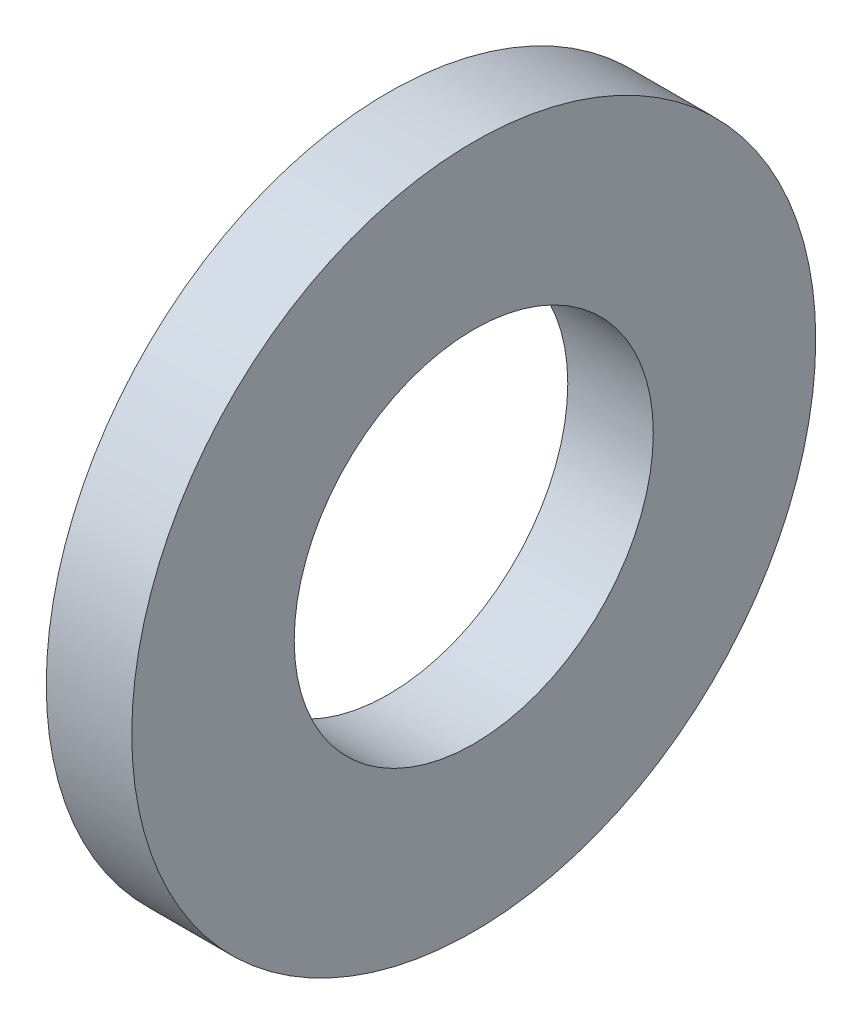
from build123d import *

# Parameters (mm, degrees)
ESQUISSE2_W = 2
ESQUISSE2_H = 3.8


with BuildPart() as part:
    # Esquisse2 → R_volution1 (revolve)
    with BuildSketch(Plane.XY, mode=Mode.PRIVATE) as r_volution1_sk:
        with Locations((1, 6.1)):
            Rectangle(ESQUISSE2_W, ESQUISSE2_H)
    revolve(r_volution1_sk.sketch.rotate(Axis((-7.455836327, 0, 0), (1, 0, 0)), 90), axis=Axis((-7.455836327, 0, 0), (1, 0, 0)))


solid = part.part
